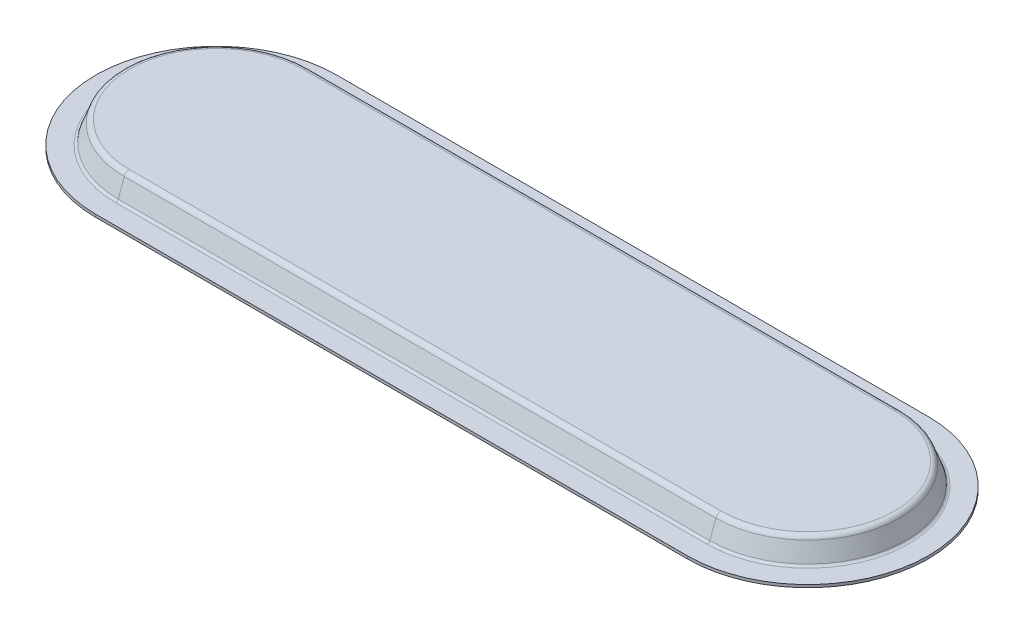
ISO-10303-21;
HEADER;
FILE_DESCRIPTION(('STEP AP214'),'2;1');
FILE_NAME('part.step','',(''),(''),'','','');
FILE_SCHEMA(('AUTOMOTIVE_DESIGN { 1 0 10303 214 1 1 1 1 }'));
ENDSEC;
DATA;
#1=APPLICATION_CONTEXT('core data for automotive mechanical design processes');
#2=APPLICATION_PROTOCOL_DEFINITION('international standard','automotive_design',2000,#1);
#3=PRODUCT_CONTEXT('',#1,'mechanical');
#4=PRODUCT('Part','Part','',(#3));
#5=PRODUCT_RELATED_PRODUCT_CATEGORY('part','',(#4));
#6=PRODUCT_DEFINITION_FORMATION('','',#4);
#7=PRODUCT_DEFINITION_CONTEXT('part definition',#1,'design');
#8=PRODUCT_DEFINITION('design','',#6,#7);
#9=PRODUCT_DEFINITION_SHAPE('','',#8);
#10=(LENGTH_UNIT() NAMED_UNIT(*) SI_UNIT(.MILLI.,.METRE.));
#11=(NAMED_UNIT(*) PLANE_ANGLE_UNIT() SI_UNIT($,.RADIAN.));
#12=(NAMED_UNIT(*) SI_UNIT($,.STERADIAN.) SOLID_ANGLE_UNIT());
#13=UNCERTAINTY_MEASURE_WITH_UNIT(LENGTH_MEASURE(1.E-05),#10,'distance_accuracy_value','');
#14=(GEOMETRIC_REPRESENTATION_CONTEXT(3) GLOBAL_UNCERTAINTY_ASSIGNED_CONTEXT((#13)) GLOBAL_UNIT_ASSIGNED_CONTEXT((#10,
#11,#12)) REPRESENTATION_CONTEXT('',''));
#15=CARTESIAN_POINT('',(0.,0.,0.));
#16=DIRECTION('',(0.,0.,1.));
#17=DIRECTION('',(1.,0.,0.));
#18=AXIS2_PLACEMENT_3D('',#15,#16,#17);
#19=CARTESIAN_POINT('',(171.45,-12.7,69.85));
#20=DIRECTION('',(0.,0.,-1.));
#21=DIRECTION('',(-1.,0.,0.));
#22=AXIS2_PLACEMENT_3D('',#19,#20,#21);
#23=PLANE('',#22);
#24=DIRECTION('',(-1.,0.,0.));
#25=VECTOR('',#24,1.);
#26=CARTESIAN_POINT('',(171.45,-1.5875,69.85));
#27=LINE('',#26,#25);
#28=CARTESIAN_POINT('',(171.45,-1.5875,69.85));
#29=VERTEX_POINT('',#28);
#30=CARTESIAN_POINT('',(-171.45,-1.5875,69.85));
#31=VERTEX_POINT('',#30);
#32=EDGE_CURVE('E299',#29,#31,#27,.T.);
#33=ORIENTED_EDGE('',*,*,#32,.F.);
#34=DIRECTION('',(0.,1.,0.));
#35=VECTOR('',#34,1.);
#36=CARTESIAN_POINT('',(171.45,-12.7,69.85));
#37=LINE('',#36,#35);
#38=CARTESIAN_POINT('',(171.45,0.,69.85));
#39=VERTEX_POINT('',#38);
#40=EDGE_CURVE('E242',#29,#39,#37,.T.);
#41=ORIENTED_EDGE('',*,*,#40,.T.);
#42=DIRECTION('',(-1.,0.,0.));
#43=VECTOR('',#42,1.);
#44=CARTESIAN_POINT('',(171.45,0.,69.85));
#45=LINE('',#44,#43);
#46=CARTESIAN_POINT('',(-171.45,0.,69.85));
#47=VERTEX_POINT('',#46);
#48=EDGE_CURVE('E319',#39,#47,#45,.T.);
#49=ORIENTED_EDGE('',*,*,#48,.T.);
#50=DIRECTION('',(0.,1.,0.));
#51=VECTOR('',#50,1.);
#52=CARTESIAN_POINT('',(-171.45,-12.7,69.85));
#53=LINE('',#52,#51);
#54=EDGE_CURVE('E329',#31,#47,#53,.T.);
#55=ORIENTED_EDGE('',*,*,#54,.F.);
#56=EDGE_LOOP('',(#33,#41,#49,#55));
#57=FACE_BOUND('',#56,.T.);
#58=ADVANCED_FACE('F38',(#57),#23,.F.);
#59=CARTESIAN_POINT('',(-171.45,-12.7,0.));
#60=DIRECTION('',(0.,1.,0.));
#61=DIRECTION('',(0.,0.,1.));
#62=AXIS2_PLACEMENT_3D('',#59,#60,#61);
#63=CYLINDRICAL_SURFACE('',#62,69.85);
#64=CARTESIAN_POINT('',(-171.45,-1.5875,0.));
#65=DIRECTION('',(0.,-1.,0.));
#66=DIRECTION('',(0.,0.,-1.));
#67=AXIS2_PLACEMENT_3D('',#64,#65,#66);
#68=CIRCLE('',#67,69.85);
#69=CARTESIAN_POINT('',(-171.45,-1.5875,-69.85));
#70=VERTEX_POINT('',#69);
#71=EDGE_CURVE('E55',#31,#70,#68,.T.);
#72=ORIENTED_EDGE('',*,*,#71,.F.);
#73=ORIENTED_EDGE('',*,*,#54,.T.);
#74=CARTESIAN_POINT('',(-171.45,0.,0.));
#75=DIRECTION('',(0.,-1.,0.));
#76=DIRECTION('',(0.,0.,-1.));
#77=AXIS2_PLACEMENT_3D('',#74,#75,#76);
#78=CIRCLE('',#77,69.85);
#79=CARTESIAN_POINT('',(-171.45,0.,-69.85));
#80=VERTEX_POINT('',#79);
#81=EDGE_CURVE('E321',#47,#80,#78,.T.);
#82=ORIENTED_EDGE('',*,*,#81,.T.);
#83=DIRECTION('',(0.,1.,0.));
#84=VECTOR('',#83,1.);
#85=CARTESIAN_POINT('',(-171.45,-12.7,-69.85));
#86=LINE('',#85,#84);
#87=EDGE_CURVE('E327',#70,#80,#86,.T.);
#88=ORIENTED_EDGE('',*,*,#87,.F.);
#89=EDGE_LOOP('',(#72,#73,#82,#88));
#90=FACE_BOUND('',#89,.T.);
#91=ADVANCED_FACE('F423',(#90),#63,.T.);
#92=CARTESIAN_POINT('',(-171.45,-12.7,-69.85));
#93=DIRECTION('',(0.,0.,1.));
#94=DIRECTION('',(1.,0.,0.));
#95=AXIS2_PLACEMENT_3D('',#92,#93,#94);
#96=PLANE('',#95);
#97=DIRECTION('',(1.,0.,0.));
#98=VECTOR('',#97,1.);
#99=CARTESIAN_POINT('',(-171.45,0.,-69.85));
#100=LINE('',#99,#98);
#101=CARTESIAN_POINT('',(171.45,0.,-69.85));
#102=VERTEX_POINT('',#101);
#103=EDGE_CURVE('E325',#80,#102,#100,.T.);
#104=ORIENTED_EDGE('',*,*,#103,.T.);
#105=DIRECTION('',(0.,1.,0.));
#106=VECTOR('',#105,1.);
#107=CARTESIAN_POINT('',(171.45,-12.7,-69.85));
#108=LINE('',#107,#106);
#109=CARTESIAN_POINT('',(171.45,-1.5875,-69.85));
#110=VERTEX_POINT('',#109);
#111=EDGE_CURVE('E238',#110,#102,#108,.T.);
#112=ORIENTED_EDGE('',*,*,#111,.F.);
#113=DIRECTION('',(1.,0.,0.));
#114=VECTOR('',#113,1.);
#115=CARTESIAN_POINT('',(-171.45,-1.5875,-69.85));
#116=LINE('',#115,#114);
#117=EDGE_CURVE('E284',#70,#110,#116,.T.);
#118=ORIENTED_EDGE('',*,*,#117,.F.);
#119=ORIENTED_EDGE('',*,*,#87,.T.);
#120=EDGE_LOOP('',(#104,#112,#118,#119));
#121=FACE_BOUND('',#120,.T.);
#122=ADVANCED_FACE('F429',(#121),#96,.F.);
#123=CARTESIAN_POINT('',(-171.45,0.,-57.15));
#124=DIRECTION('',(0.,0.342020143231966,-0.939692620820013));
#125=DIRECTION('',(0.,0.939692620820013,0.342020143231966));
#126=AXIS2_PLACEMENT_3D('',#123,#124,#125);
#127=PLANE('',#126);
#128=DIRECTION('',(1.,0.,0.));
#129=VECTOR('',#128,1.);
#130=CARTESIAN_POINT('',(171.45,10.6109139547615,-53.2879431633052));
#131=LINE('',#130,#129);
#132=CARTESIAN_POINT('',(-171.45,10.6109139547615,-53.2879431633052));
#133=VERTEX_POINT('',#132);
#134=CARTESIAN_POINT('',(171.45,10.6109139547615,-53.2879431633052));
#135=VERTEX_POINT('',#134);
#136=EDGE_CURVE('E353',#133,#135,#131,.T.);
#137=ORIENTED_EDGE('',*,*,#136,.T.);
#138=DIRECTION('',(0.,-0.939692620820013,-0.342020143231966));
#139=VECTOR('',#138,1.);
#140=CARTESIAN_POINT('',(171.45,0.,-57.15));
#141=LINE('',#140,#139);
#142=CARTESIAN_POINT('',(171.45,1.04454302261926,-56.7698174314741));
#143=VERTEX_POINT('',#142);
#144=EDGE_CURVE('E248',#135,#143,#141,.T.);
#145=ORIENTED_EDGE('',*,*,#144,.T.);
#146=DIRECTION('',(1.,0.,0.));
#147=VECTOR('',#146,1.);
#148=CARTESIAN_POINT('',(-171.45,1.04454302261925,-56.7698174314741));
#149=LINE('',#148,#147);
#150=CARTESIAN_POINT('',(-171.45,1.04454302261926,-56.7698174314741));
#151=VERTEX_POINT('',#150);
#152=EDGE_CURVE('E345',#143,#151,#149,.F.);
#153=ORIENTED_EDGE('',*,*,#152,.T.);
#154=DIRECTION('',(0.,-0.939692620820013,-0.342020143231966));
#155=VECTOR('',#154,1.);
#156=CARTESIAN_POINT('',(-171.45,0.,-57.15));
#157=LINE('',#156,#155);
#158=EDGE_CURVE('E334',#133,#151,#157,.T.);
#159=ORIENTED_EDGE('',*,*,#158,.F.);
#160=EDGE_LOOP('',(#137,#145,#153,#159));
#161=FACE_BOUND('',#160,.T.);
#162=ADVANCED_FACE('F394',(#161),#127,.T.);
#163=CARTESIAN_POINT('',(-171.45,0.,0.));
#164=DIRECTION('',(0.,-1.,0.));
#165=DIRECTION('',(0.,0.,1.));
#166=AXIS2_PLACEMENT_3D('',#163,#164,#165);
#167=CONICAL_SURFACE('',#166,57.15,0.34906585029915);
#168=DIRECTION('',(0.,-0.939692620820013,0.342020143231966));
#169=VECTOR('',#168,1.);
#170=CARTESIAN_POINT('',(-171.45,0.,57.15));
#171=LINE('',#170,#169);
#172=CARTESIAN_POINT('',(-171.45,10.6109139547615,53.2879431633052));
#173=VERTEX_POINT('',#172);
#174=CARTESIAN_POINT('',(-171.45,1.04454302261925,56.7698174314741));
#175=VERTEX_POINT('',#174);
#176=EDGE_CURVE('E332',#173,#175,#171,.T.);
#177=ORIENTED_EDGE('',*,*,#176,.F.);
#178=CARTESIAN_POINT('',(-171.45,10.6109139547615,0.));
#179=DIRECTION('',(0.,1.,0.));
#180=DIRECTION('',(0.,0.,1.));
#181=AXIS2_PLACEMENT_3D('',#178,#179,#180);
#182=CIRCLE('',#181,53.2879431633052);
#183=EDGE_CURVE('E47',#173,#133,#182,.F.);
#184=ORIENTED_EDGE('',*,*,#183,.T.);
#185=ORIENTED_EDGE('',*,*,#158,.T.);
#186=CARTESIAN_POINT('',(-171.45,1.04454302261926,0.));
#187=DIRECTION('',(0.,-1.,0.));
#188=DIRECTION('',(0.,0.,-1.));
#189=AXIS2_PLACEMENT_3D('',#186,#187,#188);
#190=CIRCLE('',#189,56.7698174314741);
#191=EDGE_CURVE('E347',#151,#175,#190,.F.);
#192=ORIENTED_EDGE('',*,*,#191,.T.);
#193=EDGE_LOOP('',(#177,#184,#185,#192));
#194=FACE_BOUND('',#193,.T.);
#195=ADVANCED_FACE('F397',(#194),#167,.T.);
#196=CARTESIAN_POINT('',(-171.45,0.,57.15));
#197=DIRECTION('',(0.,0.342020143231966,0.939692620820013));
#198=DIRECTION('',(0.,-0.939692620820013,0.342020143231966));
#199=AXIS2_PLACEMENT_3D('',#196,#197,#198);
#200=PLANE('',#199);
#201=DIRECTION('',(1.,0.,0.));
#202=VECTOR('',#201,1.);
#203=CARTESIAN_POINT('',(171.45,1.04454302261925,56.7698174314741));
#204=LINE('',#203,#202);
#205=CARTESIAN_POINT('',(171.45,1.04454302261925,56.7698174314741));
#206=VERTEX_POINT('',#205);
#207=EDGE_CURVE('E351',#175,#206,#204,.T.);
#208=ORIENTED_EDGE('',*,*,#207,.T.);
#209=DIRECTION('',(0.,-0.939692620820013,0.342020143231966));
#210=VECTOR('',#209,1.);
#211=CARTESIAN_POINT('',(171.45,0.,57.15));
#212=LINE('',#211,#210);
#213=CARTESIAN_POINT('',(171.45,10.6109139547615,53.2879431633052));
#214=VERTEX_POINT('',#213);
#215=EDGE_CURVE('E245',#214,#206,#212,.T.);
#216=ORIENTED_EDGE('',*,*,#215,.F.);
#217=DIRECTION('',(1.,0.,0.));
#218=VECTOR('',#217,1.);
#219=CARTESIAN_POINT('',(-171.45,10.6109139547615,53.2879431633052));
#220=LINE('',#219,#218);
#221=EDGE_CURVE('E11',#214,#173,#220,.F.);
#222=ORIENTED_EDGE('',*,*,#221,.T.);
#223=ORIENTED_EDGE('',*,*,#176,.T.);
#224=EDGE_LOOP('',(#208,#216,#222,#223));
#225=FACE_BOUND('',#224,.T.);
#226=ADVANCED_FACE('F412',(#225),#200,.T.);
#227=CARTESIAN_POINT('',(171.45,12.7,0.));
#228=DIRECTION('',(0.,-1.,0.));
#229=DIRECTION('',(0.,0.,-1.));
#230=AXIS2_PLACEMENT_3D('',#227,#228,#229);
#231=PLANE('',#230);
#232=DIRECTION('',(-1.,0.,0.));
#233=VECTOR('',#232,1.);
#234=CARTESIAN_POINT('',(171.45,12.7,50.3044190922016));
#235=LINE('',#234,#233);
#236=CARTESIAN_POINT('',(-171.45,12.7,50.3044190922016));
#237=VERTEX_POINT('',#236);
#238=CARTESIAN_POINT('',(171.45,12.7,50.3044190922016));
#239=VERTEX_POINT('',#238);
#240=EDGE_CURVE('E360',#237,#239,#235,.F.);
#241=ORIENTED_EDGE('',*,*,#240,.T.);
#242=CARTESIAN_POINT('',(171.45,12.7,0.));
#243=DIRECTION('',(0.,1.,0.));
#244=DIRECTION('',(0.,0.,-1.));
#245=AXIS2_PLACEMENT_3D('',#242,#243,#244);
#246=CIRCLE('',#245,50.3044190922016);
#247=CARTESIAN_POINT('',(171.45,12.7,-50.3044190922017));
#248=VERTEX_POINT('',#247);
#249=EDGE_CURVE('E259',#248,#239,#246,.F.);
#250=ORIENTED_EDGE('',*,*,#249,.F.);
#251=DIRECTION('',(1.,0.,0.));
#252=VECTOR('',#251,1.);
#253=CARTESIAN_POINT('',(-171.45,12.7,-50.3044190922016));
#254=LINE('',#253,#252);
#255=CARTESIAN_POINT('',(-171.45,12.7,-50.3044190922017));
#256=VERTEX_POINT('',#255);
#257=EDGE_CURVE('E365',#248,#256,#254,.F.);
#258=ORIENTED_EDGE('',*,*,#257,.T.);
#259=CARTESIAN_POINT('',(-171.45,12.7,0.));
#260=DIRECTION('',(0.,-1.,0.));
#261=DIRECTION('',(0.,0.,-1.));
#262=AXIS2_PLACEMENT_3D('',#259,#260,#261);
#263=CIRCLE('',#262,50.3044190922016);
#264=EDGE_CURVE('E362',#256,#237,#263,.F.);
#265=ORIENTED_EDGE('',*,*,#264,.T.);
#266=EDGE_LOOP('',(#241,#250,#258,#265));
#267=FACE_BOUND('',#266,.T.);
#268=ADVANCED_FACE('F383',(#267),#231,.F.);
#269=CARTESIAN_POINT('',(171.45,0.,0.));
#270=DIRECTION('',(0.,-1.,0.));
#271=DIRECTION('',(0.,0.,-1.));
#272=AXIS2_PLACEMENT_3D('',#269,#270,#271);
#273=PLANE('',#272);
#274=CARTESIAN_POINT('',(171.45,0.,0.));
#275=DIRECTION('',(0.,1.,0.));
#276=DIRECTION('',(0.,0.,-1.));
#277=AXIS2_PLACEMENT_3D('',#274,#275,#276);
#278=CIRCLE('',#277,58.2615794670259);
#279=CARTESIAN_POINT('',(171.45,0.,58.2615794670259));
#280=VERTEX_POINT('',#279);
#281=CARTESIAN_POINT('',(171.45,0.,-58.2615794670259));
#282=VERTEX_POINT('',#281);
#283=EDGE_CURVE('E251',#280,#282,#278,.T.);
#284=ORIENTED_EDGE('',*,*,#283,.F.);
#285=DIRECTION('',(-1.,0.,0.));
#286=VECTOR('',#285,1.);
#287=CARTESIAN_POINT('',(-171.45,0.,58.2615794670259));
#288=LINE('',#287,#286);
#289=CARTESIAN_POINT('',(-171.45,0.,58.2615794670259));
#290=VERTEX_POINT('',#289);
#291=EDGE_CURVE('E337',#280,#290,#288,.T.);
#292=ORIENTED_EDGE('',*,*,#291,.T.);
#293=CARTESIAN_POINT('',(-171.45,0.,0.));
#294=DIRECTION('',(0.,-1.,0.));
#295=DIRECTION('',(0.,0.,-1.));
#296=AXIS2_PLACEMENT_3D('',#293,#294,#295);
#297=CIRCLE('',#296,58.2615794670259);
#298=CARTESIAN_POINT('',(-171.45,0.,-58.2615794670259));
#299=VERTEX_POINT('',#298);
#300=EDGE_CURVE('E339',#290,#299,#297,.T.);
#301=ORIENTED_EDGE('',*,*,#300,.T.);
#302=DIRECTION('',(1.,0.,0.));
#303=VECTOR('',#302,1.);
#304=CARTESIAN_POINT('',(171.45,0.,-58.2615794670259));
#305=LINE('',#304,#303);
#306=EDGE_CURVE('E342',#299,#282,#305,.T.);
#307=ORIENTED_EDGE('',*,*,#306,.T.);
#308=EDGE_LOOP('',(#284,#292,#301,#307));
#309=FACE_BOUND('',#308,.T.);
#310=ORIENTED_EDGE('',*,*,#48,.F.);
#311=CARTESIAN_POINT('',(171.45,0.,0.));
#312=DIRECTION('',(0.,1.,0.));
#313=DIRECTION('',(0.,0.,-1.));
#314=AXIS2_PLACEMENT_3D('',#311,#312,#313);
#315=CIRCLE('',#314,69.85);
#316=EDGE_CURVE('E235',#39,#102,#315,.T.);
#317=ORIENTED_EDGE('',*,*,#316,.T.);
#318=ORIENTED_EDGE('',*,*,#103,.F.);
#319=ORIENTED_EDGE('',*,*,#81,.F.);
#320=EDGE_LOOP('',(#310,#317,#318,#319));
#321=FACE_BOUND('',#320,.T.);
#322=ADVANCED_FACE('F419',(#309,#321),#273,.F.);
#323=CARTESIAN_POINT('',(-171.45,1.5875,58.2615794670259));
#324=DIRECTION('',(1.,0.,0.));
#325=DIRECTION('',(0.,0.,-1.));
#326=AXIS2_PLACEMENT_3D('',#323,#324,#325);
#327=CYLINDRICAL_SURFACE('',#326,1.5875);
#328=ORIENTED_EDGE('',*,*,#291,.F.);
#329=CARTESIAN_POINT('',(171.45,1.5875,58.2615794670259));
#330=DIRECTION('',(1.,0.,0.));
#331=DIRECTION('',(0.,0.,-1.));
#332=AXIS2_PLACEMENT_3D('',#329,#330,#331);
#333=CIRCLE('',#332,1.5875);
#334=EDGE_CURVE('E239',#280,#206,#333,.T.);
#335=ORIENTED_EDGE('',*,*,#334,.T.);
#336=ORIENTED_EDGE('',*,*,#207,.F.);
#337=CARTESIAN_POINT('',(-171.45,1.5875,58.2615794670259));
#338=DIRECTION('',(1.,0.,0.));
#339=DIRECTION('',(0.,0.,-1.));
#340=AXIS2_PLACEMENT_3D('',#337,#338,#339);
#341=CIRCLE('',#340,1.5875);
#342=EDGE_CURVE('E322',#290,#175,#341,.T.);
#343=ORIENTED_EDGE('',*,*,#342,.F.);
#344=EDGE_LOOP('',(#328,#335,#336,#343));
#345=FACE_BOUND('',#344,.T.);
#346=ADVANCED_FACE('F410',(#345),#327,.F.);
#347=CARTESIAN_POINT('',(-171.45,1.5875,0.));
#348=DIRECTION('',(0.,-1.,0.));
#349=DIRECTION('',(0.,0.,-1.));
#350=AXIS2_PLACEMENT_3D('',#347,#348,#349);
#351=TOROIDAL_SURFACE('',#350,58.2615794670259,1.5875);
#352=ORIENTED_EDGE('',*,*,#342,.T.);
#353=ORIENTED_EDGE('',*,*,#191,.F.);
#354=CARTESIAN_POINT('',(-171.45,1.5875,-58.2615794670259));
#355=DIRECTION('',(-1.,0.,0.));
#356=DIRECTION('',(0.,0.,1.));
#357=AXIS2_PLACEMENT_3D('',#354,#355,#356);
#358=CIRCLE('',#357,1.5875);
#359=EDGE_CURVE('E354',#299,#151,#358,.T.);
#360=ORIENTED_EDGE('',*,*,#359,.F.);
#361=ORIENTED_EDGE('',*,*,#300,.F.);
#362=EDGE_LOOP('',(#352,#353,#360,#361));
#363=FACE_BOUND('',#362,.T.);
#364=ADVANCED_FACE('F407',(#363),#351,.F.);
#365=CARTESIAN_POINT('',(171.45,1.5875,-58.2615794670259));
#366=DIRECTION('',(1.,0.,0.));
#367=DIRECTION('',(0.,0.,-1.));
#368=AXIS2_PLACEMENT_3D('',#365,#366,#367);
#369=CYLINDRICAL_SURFACE('',#368,1.5875);
#370=ORIENTED_EDGE('',*,*,#152,.F.);
#371=CARTESIAN_POINT('',(171.45,1.5875,-58.2615794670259));
#372=DIRECTION('',(-1.,0.,0.));
#373=DIRECTION('',(0.,0.,1.));
#374=AXIS2_PLACEMENT_3D('',#371,#372,#373);
#375=CIRCLE('',#374,1.5875);
#376=EDGE_CURVE('E260',#282,#143,#375,.T.);
#377=ORIENTED_EDGE('',*,*,#376,.F.);
#378=ORIENTED_EDGE('',*,*,#306,.F.);
#379=ORIENTED_EDGE('',*,*,#359,.T.);
#380=EDGE_LOOP('',(#370,#377,#378,#379));
#381=FACE_BOUND('',#380,.T.);
#382=ADVANCED_FACE('F403',(#381),#369,.F.);
#383=CARTESIAN_POINT('',(171.45,9.525,50.3044190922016));
#384=DIRECTION('',(-1.,0.,0.));
#385=DIRECTION('',(0.,0.,1.));
#386=AXIS2_PLACEMENT_3D('',#383,#384,#385);
#387=CYLINDRICAL_SURFACE('',#386,3.175);
#388=ORIENTED_EDGE('',*,*,#221,.F.);
#389=CARTESIAN_POINT('',(171.45,9.525,50.3044190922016));
#390=DIRECTION('',(-1.,0.,0.));
#391=DIRECTION('',(0.,0.,1.));
#392=AXIS2_PLACEMENT_3D('',#389,#390,#391);
#393=CIRCLE('',#392,3.175);
#394=EDGE_CURVE('E263',#214,#239,#393,.T.);
#395=ORIENTED_EDGE('',*,*,#394,.T.);
#396=ORIENTED_EDGE('',*,*,#240,.F.);
#397=CARTESIAN_POINT('',(-171.45,9.525,50.3044190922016));
#398=DIRECTION('',(-1.,0.,0.));
#399=DIRECTION('',(0.,0.,1.));
#400=AXIS2_PLACEMENT_3D('',#397,#398,#399);
#401=CIRCLE('',#400,3.175);
#402=EDGE_CURVE('E42',#173,#237,#401,.T.);
#403=ORIENTED_EDGE('',*,*,#402,.F.);
#404=EDGE_LOOP('',(#388,#395,#396,#403));
#405=FACE_BOUND('',#404,.T.);
#406=ADVANCED_FACE('F40',(#405),#387,.T.);
#407=CARTESIAN_POINT('',(-171.45,9.525,0.));
#408=DIRECTION('',(0.,-1.,0.));
#409=DIRECTION('',(0.,0.,-1.));
#410=AXIS2_PLACEMENT_3D('',#407,#408,#409);
#411=TOROIDAL_SURFACE('',#410,50.3044190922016,3.175);
#412=ORIENTED_EDGE('',*,*,#402,.T.);
#413=ORIENTED_EDGE('',*,*,#264,.F.);
#414=CARTESIAN_POINT('',(-171.45,9.525,-50.3044190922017));
#415=DIRECTION('',(1.,0.,0.));
#416=DIRECTION('',(0.,0.,-1.));
#417=AXIS2_PLACEMENT_3D('',#414,#415,#416);
#418=CIRCLE('',#417,3.175);
#419=EDGE_CURVE('E294',#133,#256,#418,.T.);
#420=ORIENTED_EDGE('',*,*,#419,.F.);
#421=ORIENTED_EDGE('',*,*,#183,.F.);
#422=EDGE_LOOP('',(#412,#413,#420,#421));
#423=FACE_BOUND('',#422,.T.);
#424=ADVANCED_FACE('F377',(#423),#411,.T.);
#425=CARTESIAN_POINT('',(-171.45,9.525,-50.3044190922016));
#426=DIRECTION('',(-1.,0.,0.));
#427=DIRECTION('',(0.,0.,1.));
#428=AXIS2_PLACEMENT_3D('',#425,#426,#427);
#429=CYLINDRICAL_SURFACE('',#428,3.175);
#430=ORIENTED_EDGE('',*,*,#257,.F.);
#431=CARTESIAN_POINT('',(171.45,9.525,-50.3044190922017));
#432=DIRECTION('',(1.,0.,0.));
#433=DIRECTION('',(0.,0.,-1.));
#434=AXIS2_PLACEMENT_3D('',#431,#432,#433);
#435=CIRCLE('',#434,3.175);
#436=EDGE_CURVE('E223',#135,#248,#435,.T.);
#437=ORIENTED_EDGE('',*,*,#436,.F.);
#438=ORIENTED_EDGE('',*,*,#136,.F.);
#439=ORIENTED_EDGE('',*,*,#419,.T.);
#440=EDGE_LOOP('',(#430,#437,#438,#439));
#441=FACE_BOUND('',#440,.T.);
#442=ADVANCED_FACE('F385',(#441),#429,.T.);
#443=CARTESIAN_POINT('',(-171.45,-0.542956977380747,-55.6582379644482));
#444=DIRECTION('',(0.,0.342020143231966,-0.939692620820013));
#445=DIRECTION('',(0.,0.939692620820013,0.342020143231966));
#446=AXIS2_PLACEMENT_3D('',#443,#444,#445);
#447=PLANE('',#446);
#448=DIRECTION('',(1.,0.,0.));
#449=VECTOR('',#448,1.);
#450=CARTESIAN_POINT('',(-171.45,0.501586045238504,-55.2780553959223));
#451=LINE('',#450,#449);
#452=CARTESIAN_POINT('',(171.45,0.501586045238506,-55.2780553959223));
#453=VERTEX_POINT('',#452);
#454=CARTESIAN_POINT('',(-171.45,0.501586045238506,-55.2780553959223));
#455=VERTEX_POINT('',#454);
#456=EDGE_CURVE('E175',#453,#455,#451,.F.);
#457=ORIENTED_EDGE('',*,*,#456,.F.);
#458=DIRECTION('',(0.,-0.939692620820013,-0.342020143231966));
#459=VECTOR('',#458,1.);
#460=CARTESIAN_POINT('',(171.45,-0.542956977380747,-55.6582379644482));
#461=LINE('',#460,#459);
#462=CARTESIAN_POINT('',(171.45,10.0679569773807,-51.7961811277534));
#463=VERTEX_POINT('',#462);
#464=EDGE_CURVE('E180',#463,#453,#461,.T.);
#465=ORIENTED_EDGE('',*,*,#464,.F.);
#466=DIRECTION('',(1.,0.,0.));
#467=VECTOR('',#466,1.);
#468=CARTESIAN_POINT('',(-171.45,10.0679569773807,-51.7961811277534));
#469=LINE('',#468,#467);
#470=CARTESIAN_POINT('',(-171.45,10.0679569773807,-51.7961811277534));
#471=VERTEX_POINT('',#470);
#472=EDGE_CURVE('E279',#471,#463,#469,.T.);
#473=ORIENTED_EDGE('',*,*,#472,.F.);
#474=DIRECTION('',(0.,-0.939692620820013,-0.342020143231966));
#475=VECTOR('',#474,1.);
#476=CARTESIAN_POINT('',(-171.45,-0.542956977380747,-55.6582379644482));
#477=LINE('',#476,#475);
#478=EDGE_CURVE('E182',#471,#455,#477,.T.);
#479=ORIENTED_EDGE('',*,*,#478,.T.);
#480=EDGE_LOOP('',(#457,#465,#473,#479));
#481=FACE_BOUND('',#480,.T.);
#482=ADVANCED_FACE('F177',(#481),#447,.F.);
#483=CARTESIAN_POINT('',(-171.45,-0.542956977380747,0.));
#484=DIRECTION('',(0.,-1.,0.));
#485=DIRECTION('',(0.,0.,1.));
#486=AXIS2_PLACEMENT_3D('',#483,#484,#485);
#487=CONICAL_SURFACE('',#486,55.6582379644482,0.34906585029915);
#488=DIRECTION('',(0.,-0.939692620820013,0.342020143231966));
#489=VECTOR('',#488,1.);
#490=CARTESIAN_POINT('',(-171.45,-0.542956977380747,55.6582379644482));
#491=LINE('',#490,#489);
#492=CARTESIAN_POINT('',(-171.45,10.0679569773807,51.7961811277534));
#493=VERTEX_POINT('',#492);
#494=CARTESIAN_POINT('',(-171.45,0.501586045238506,55.2780553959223));
#495=VERTEX_POINT('',#494);
#496=EDGE_CURVE('E278',#493,#495,#491,.T.);
#497=ORIENTED_EDGE('',*,*,#496,.T.);
#498=CARTESIAN_POINT('',(-171.45,0.501586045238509,0.));
#499=DIRECTION('',(0.,-1.,0.));
#500=DIRECTION('',(0.,0.,-1.));
#501=AXIS2_PLACEMENT_3D('',#498,#499,#500);
#502=CIRCLE('',#501,55.2780553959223);
#503=EDGE_CURVE('E186',#455,#495,#502,.F.);
#504=ORIENTED_EDGE('',*,*,#503,.F.);
#505=ORIENTED_EDGE('',*,*,#478,.F.);
#506=CARTESIAN_POINT('',(-171.45,10.0679569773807,0.));
#507=DIRECTION('',(0.,-1.,0.));
#508=DIRECTION('',(0.,0.,-1.));
#509=AXIS2_PLACEMENT_3D('',#506,#507,#508);
#510=CIRCLE('',#509,51.7961811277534);
#511=EDGE_CURVE('E285',#493,#471,#510,.T.);
#512=ORIENTED_EDGE('',*,*,#511,.F.);
#513=EDGE_LOOP('',(#497,#504,#505,#512));
#514=FACE_BOUND('',#513,.T.);
#515=ADVANCED_FACE('F473',(#514),#487,.F.);
#516=CARTESIAN_POINT('',(-171.45,-0.542956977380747,55.6582379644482));
#517=DIRECTION('',(0.,0.342020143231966,0.939692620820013));
#518=DIRECTION('',(0.,-0.939692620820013,0.342020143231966));
#519=AXIS2_PLACEMENT_3D('',#516,#517,#518);
#520=PLANE('',#519);
#521=DIRECTION('',(1.,0.,0.));
#522=VECTOR('',#521,1.);
#523=CARTESIAN_POINT('',(-171.45,10.0679569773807,51.7961811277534));
#524=LINE('',#523,#522);
#525=CARTESIAN_POINT('',(171.45,10.0679569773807,51.7961811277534));
#526=VERTEX_POINT('',#525);
#527=EDGE_CURVE('E288',#526,#493,#524,.F.);
#528=ORIENTED_EDGE('',*,*,#527,.F.);
#529=DIRECTION('',(0.,-0.939692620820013,0.342020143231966));
#530=VECTOR('',#529,1.);
#531=CARTESIAN_POINT('',(171.45,-0.542956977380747,55.6582379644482));
#532=LINE('',#531,#530);
#533=CARTESIAN_POINT('',(171.45,0.501586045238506,55.2780553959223));
#534=VERTEX_POINT('',#533);
#535=EDGE_CURVE('E216',#526,#534,#532,.T.);
#536=ORIENTED_EDGE('',*,*,#535,.T.);
#537=DIRECTION('',(1.,0.,0.));
#538=VECTOR('',#537,1.);
#539=CARTESIAN_POINT('',(-171.45,0.501586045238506,55.2780553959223));
#540=LINE('',#539,#538);
#541=EDGE_CURVE('E281',#495,#534,#540,.T.);
#542=ORIENTED_EDGE('',*,*,#541,.F.);
#543=ORIENTED_EDGE('',*,*,#496,.F.);
#544=EDGE_LOOP('',(#528,#536,#542,#543));
#545=FACE_BOUND('',#544,.T.);
#546=ADVANCED_FACE('F469',(#545),#520,.F.);
#547=CARTESIAN_POINT('',(171.45,11.1125,0.));
#548=DIRECTION('',(0.,-1.,0.));
#549=DIRECTION('',(0.,0.,-1.));
#550=AXIS2_PLACEMENT_3D('',#547,#548,#549);
#551=PLANE('',#550);
#552=DIRECTION('',(1.,0.,0.));
#553=VECTOR('',#552,1.);
#554=CARTESIAN_POINT('',(171.45,11.1125,-50.3044190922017));
#555=LINE('',#554,#553);
#556=CARTESIAN_POINT('',(171.45,11.1125,-50.3044190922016));
#557=VERTEX_POINT('',#556);
#558=CARTESIAN_POINT('',(-171.45,11.1125,-50.3044190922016));
#559=VERTEX_POINT('',#558);
#560=EDGE_CURVE('E289',#557,#559,#555,.F.);
#561=ORIENTED_EDGE('',*,*,#560,.F.);
#562=CARTESIAN_POINT('',(171.45,11.1125,0.));
#563=DIRECTION('',(0.,1.,0.));
#564=DIRECTION('',(0.,0.,-1.));
#565=AXIS2_PLACEMENT_3D('',#562,#563,#564);
#566=CIRCLE('',#565,50.3044190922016);
#567=CARTESIAN_POINT('',(171.45,11.1125,50.3044190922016));
#568=VERTEX_POINT('',#567);
#569=EDGE_CURVE('E209',#557,#568,#566,.F.);
#570=ORIENTED_EDGE('',*,*,#569,.T.);
#571=DIRECTION('',(1.,0.,0.));
#572=VECTOR('',#571,1.);
#573=CARTESIAN_POINT('',(171.45,11.1125,50.3044190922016));
#574=LINE('',#573,#572);
#575=CARTESIAN_POINT('',(-171.45,11.1125,50.3044190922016));
#576=VERTEX_POINT('',#575);
#577=EDGE_CURVE('E280',#576,#568,#574,.T.);
#578=ORIENTED_EDGE('',*,*,#577,.F.);
#579=CARTESIAN_POINT('',(-171.45,11.1125,0.));
#580=DIRECTION('',(0.,-1.,0.));
#581=DIRECTION('',(0.,0.,-1.));
#582=AXIS2_PLACEMENT_3D('',#579,#580,#581);
#583=CIRCLE('',#582,50.3044190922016);
#584=EDGE_CURVE('E308',#559,#576,#583,.F.);
#585=ORIENTED_EDGE('',*,*,#584,.F.);
#586=EDGE_LOOP('',(#561,#570,#578,#585));
#587=FACE_BOUND('',#586,.T.);
#588=ADVANCED_FACE('F465',(#587),#551,.T.);
#589=CARTESIAN_POINT('',(171.45,-1.5875,0.));
#590=DIRECTION('',(0.,-1.,0.));
#591=DIRECTION('',(0.,0.,-1.));
#592=AXIS2_PLACEMENT_3D('',#589,#590,#591);
#593=PLANE('',#592);
#594=DIRECTION('',(1.,0.,0.));
#595=VECTOR('',#594,1.);
#596=CARTESIAN_POINT('',(171.45,-1.5875,58.2615794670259));
#597=LINE('',#596,#595);
#598=CARTESIAN_POINT('',(171.45,-1.5875,58.2615794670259));
#599=VERTEX_POINT('',#598);
#600=CARTESIAN_POINT('',(-171.45,-1.5875,58.2615794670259));
#601=VERTEX_POINT('',#600);
#602=EDGE_CURVE('E277',#599,#601,#597,.F.);
#603=ORIENTED_EDGE('',*,*,#602,.F.);
#604=CARTESIAN_POINT('',(171.45,-1.5875,0.));
#605=DIRECTION('',(0.,1.,0.));
#606=DIRECTION('',(0.,0.,-1.));
#607=AXIS2_PLACEMENT_3D('',#604,#605,#606);
#608=CIRCLE('',#607,58.2615794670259);
#609=CARTESIAN_POINT('',(171.45,-1.5875,-58.2615794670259));
#610=VERTEX_POINT('',#609);
#611=EDGE_CURVE('E210',#599,#610,#608,.T.);
#612=ORIENTED_EDGE('',*,*,#611,.T.);
#613=DIRECTION('',(1.,0.,0.));
#614=VECTOR('',#613,1.);
#615=CARTESIAN_POINT('',(171.45,-1.5875,-58.2615794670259));
#616=LINE('',#615,#614);
#617=CARTESIAN_POINT('',(-171.45,-1.5875,-58.2615794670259));
#618=VERTEX_POINT('',#617);
#619=EDGE_CURVE('E187',#618,#610,#616,.T.);
#620=ORIENTED_EDGE('',*,*,#619,.F.);
#621=CARTESIAN_POINT('',(-171.45,-1.5875,0.));
#622=DIRECTION('',(0.,-1.,0.));
#623=DIRECTION('',(0.,0.,-1.));
#624=AXIS2_PLACEMENT_3D('',#621,#622,#623);
#625=CIRCLE('',#624,58.2615794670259);
#626=EDGE_CURVE('E302',#601,#618,#625,.T.);
#627=ORIENTED_EDGE('',*,*,#626,.F.);
#628=EDGE_LOOP('',(#603,#612,#620,#627));
#629=FACE_BOUND('',#628,.T.);
#630=CARTESIAN_POINT('',(171.45,-1.5875,0.));
#631=DIRECTION('',(0.,1.,0.));
#632=DIRECTION('',(0.,0.,-1.));
#633=AXIS2_PLACEMENT_3D('',#630,#631,#632);
#634=CIRCLE('',#633,69.85);
#635=EDGE_CURVE('E220',#29,#110,#634,.T.);
#636=ORIENTED_EDGE('',*,*,#635,.F.);
#637=ORIENTED_EDGE('',*,*,#32,.T.);
#638=ORIENTED_EDGE('',*,*,#71,.T.);
#639=ORIENTED_EDGE('',*,*,#117,.T.);
#640=EDGE_LOOP('',(#636,#637,#638,#639));
#641=FACE_BOUND('',#640,.T.);
#642=ADVANCED_FACE('F461',(#629,#641),#593,.T.);
#643=CARTESIAN_POINT('',(-171.45,1.5875,58.2615794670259));
#644=DIRECTION('',(1.,0.,0.));
#645=DIRECTION('',(0.,0.,-1.));
#646=AXIS2_PLACEMENT_3D('',#643,#644,#645);
#647=CYLINDRICAL_SURFACE('',#646,3.175);
#648=ORIENTED_EDGE('',*,*,#541,.T.);
#649=CARTESIAN_POINT('',(171.45,1.5875,58.2615794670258));
#650=DIRECTION('',(1.,0.,0.));
#651=DIRECTION('',(0.,0.,-1.));
#652=AXIS2_PLACEMENT_3D('',#649,#650,#651);
#653=CIRCLE('',#652,3.175);
#654=EDGE_CURVE('E197',#599,#534,#653,.T.);
#655=ORIENTED_EDGE('',*,*,#654,.F.);
#656=ORIENTED_EDGE('',*,*,#602,.T.);
#657=CARTESIAN_POINT('',(-171.45,1.5875,58.2615794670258));
#658=DIRECTION('',(1.,0.,0.));
#659=DIRECTION('',(0.,0.,-1.));
#660=AXIS2_PLACEMENT_3D('',#657,#658,#659);
#661=CIRCLE('',#660,3.175);
#662=EDGE_CURVE('E296',#601,#495,#661,.T.);
#663=ORIENTED_EDGE('',*,*,#662,.T.);
#664=EDGE_LOOP('',(#648,#655,#656,#663));
#665=FACE_BOUND('',#664,.T.);
#666=ADVANCED_FACE('F457',(#665),#647,.T.);
#667=CARTESIAN_POINT('',(-171.45,1.5875,0.));
#668=DIRECTION('',(0.,-1.,0.));
#669=DIRECTION('',(0.,0.,-1.));
#670=AXIS2_PLACEMENT_3D('',#667,#668,#669);
#671=TOROIDAL_SURFACE('',#670,58.2615794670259,3.175);
#672=ORIENTED_EDGE('',*,*,#662,.F.);
#673=ORIENTED_EDGE('',*,*,#626,.T.);
#674=CARTESIAN_POINT('',(-171.45,1.5875,-58.2615794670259));
#675=DIRECTION('',(1.,0.,0.));
#676=DIRECTION('',(0.,0.,-1.));
#677=AXIS2_PLACEMENT_3D('',#674,#675,#676);
#678=CIRCLE('',#677,3.175);
#679=EDGE_CURVE('E300',#618,#455,#678,.F.);
#680=ORIENTED_EDGE('',*,*,#679,.T.);
#681=ORIENTED_EDGE('',*,*,#503,.T.);
#682=EDGE_LOOP('',(#672,#673,#680,#681));
#683=FACE_BOUND('',#682,.T.);
#684=ADVANCED_FACE('F454',(#683),#671,.T.);
#685=CARTESIAN_POINT('',(171.45,1.5875,-58.2615794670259));
#686=DIRECTION('',(1.,0.,0.));
#687=DIRECTION('',(0.,0.,-1.));
#688=AXIS2_PLACEMENT_3D('',#685,#686,#687);
#689=CYLINDRICAL_SURFACE('',#688,3.175);
#690=ORIENTED_EDGE('',*,*,#619,.T.);
#691=CARTESIAN_POINT('',(171.45,1.5875,-58.2615794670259));
#692=DIRECTION('',(1.,0.,0.));
#693=DIRECTION('',(0.,0.,-1.));
#694=AXIS2_PLACEMENT_3D('',#691,#692,#693);
#695=CIRCLE('',#694,3.175);
#696=EDGE_CURVE('E190',#610,#453,#695,.F.);
#697=ORIENTED_EDGE('',*,*,#696,.T.);
#698=ORIENTED_EDGE('',*,*,#456,.T.);
#699=ORIENTED_EDGE('',*,*,#679,.F.);
#700=EDGE_LOOP('',(#690,#697,#698,#699));
#701=FACE_BOUND('',#700,.T.);
#702=ADVANCED_FACE('F192',(#701),#689,.T.);
#703=CARTESIAN_POINT('',(171.45,9.525,50.3044190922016));
#704=DIRECTION('',(-1.,0.,0.));
#705=DIRECTION('',(0.,0.,1.));
#706=AXIS2_PLACEMENT_3D('',#703,#704,#705);
#707=CYLINDRICAL_SURFACE('',#706,1.5875);
#708=ORIENTED_EDGE('',*,*,#577,.T.);
#709=CARTESIAN_POINT('',(171.45,9.525,50.3044190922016));
#710=DIRECTION('',(1.,0.,0.));
#711=DIRECTION('',(0.,0.,-1.));
#712=AXIS2_PLACEMENT_3D('',#709,#710,#711);
#713=CIRCLE('',#712,1.5875);
#714=EDGE_CURVE('E198',#526,#568,#713,.F.);
#715=ORIENTED_EDGE('',*,*,#714,.F.);
#716=ORIENTED_EDGE('',*,*,#527,.T.);
#717=CARTESIAN_POINT('',(-171.45,9.525,50.3044190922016));
#718=DIRECTION('',(1.,0.,0.));
#719=DIRECTION('',(0.,0.,-1.));
#720=AXIS2_PLACEMENT_3D('',#717,#718,#719);
#721=CIRCLE('',#720,1.5875);
#722=EDGE_CURVE('E306',#493,#576,#721,.F.);
#723=ORIENTED_EDGE('',*,*,#722,.T.);
#724=EDGE_LOOP('',(#708,#715,#716,#723));
#725=FACE_BOUND('',#724,.T.);
#726=ADVANCED_FACE('F447',(#725),#707,.F.);
#727=CARTESIAN_POINT('',(-171.45,9.525,0.));
#728=DIRECTION('',(0.,-1.,0.));
#729=DIRECTION('',(0.,0.,-1.));
#730=AXIS2_PLACEMENT_3D('',#727,#728,#729);
#731=TOROIDAL_SURFACE('',#730,50.3044190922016,1.5875);
#732=ORIENTED_EDGE('',*,*,#722,.F.);
#733=ORIENTED_EDGE('',*,*,#511,.T.);
#734=CARTESIAN_POINT('',(-171.45,9.525,-50.3044190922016));
#735=DIRECTION('',(-1.,0.,0.));
#736=DIRECTION('',(0.,0.,1.));
#737=AXIS2_PLACEMENT_3D('',#734,#735,#736);
#738=CIRCLE('',#737,1.5875);
#739=EDGE_CURVE('E271',#471,#559,#738,.F.);
#740=ORIENTED_EDGE('',*,*,#739,.T.);
#741=ORIENTED_EDGE('',*,*,#584,.T.);
#742=EDGE_LOOP('',(#732,#733,#740,#741));
#743=FACE_BOUND('',#742,.T.);
#744=ADVANCED_FACE('F443',(#743),#731,.F.);
#745=CARTESIAN_POINT('',(-171.45,9.525,-50.3044190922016));
#746=DIRECTION('',(-1.,0.,0.));
#747=DIRECTION('',(0.,0.,1.));
#748=AXIS2_PLACEMENT_3D('',#745,#746,#747);
#749=CYLINDRICAL_SURFACE('',#748,1.5875);
#750=ORIENTED_EDGE('',*,*,#472,.T.);
#751=CARTESIAN_POINT('',(171.45,9.525,-50.3044190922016));
#752=DIRECTION('',(-1.,0.,0.));
#753=DIRECTION('',(0.,0.,1.));
#754=AXIS2_PLACEMENT_3D('',#751,#752,#753);
#755=CIRCLE('',#754,1.5875);
#756=EDGE_CURVE('E228',#463,#557,#755,.F.);
#757=ORIENTED_EDGE('',*,*,#756,.T.);
#758=ORIENTED_EDGE('',*,*,#560,.T.);
#759=ORIENTED_EDGE('',*,*,#739,.F.);
#760=EDGE_LOOP('',(#750,#757,#758,#759));
#761=FACE_BOUND('',#760,.T.);
#762=ADVANCED_FACE('F439',(#761),#749,.F.);
#763=CARTESIAN_POINT('',(171.45,-12.7,0.));
#764=DIRECTION('',(0.,1.,0.));
#765=DIRECTION('',(0.,0.,1.));
#766=AXIS2_PLACEMENT_3D('',#763,#764,#765);
#767=CYLINDRICAL_SURFACE('',#766,69.85);
#768=ORIENTED_EDGE('',*,*,#635,.T.);
#769=ORIENTED_EDGE('',*,*,#111,.T.);
#770=ORIENTED_EDGE('',*,*,#316,.F.);
#771=ORIENTED_EDGE('',*,*,#40,.F.);
#772=EDGE_LOOP('',(#768,#769,#770,#771));
#773=FACE_BOUND('',#772,.T.);
#774=ADVANCED_FACE('F442',(#773),#767,.T.);
#775=CARTESIAN_POINT('',(171.45,0.,0.));
#776=DIRECTION('',(0.,-1.,0.));
#777=DIRECTION('',(0.,0.,1.));
#778=AXIS2_PLACEMENT_3D('',#775,#776,#777);
#779=CONICAL_SURFACE('',#778,57.15,0.34906585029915);
#780=ORIENTED_EDGE('',*,*,#215,.T.);
#781=CARTESIAN_POINT('',(171.45,1.04454302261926,0.));
#782=DIRECTION('',(0.,1.,0.));
#783=DIRECTION('',(0.,0.,-1.));
#784=AXIS2_PLACEMENT_3D('',#781,#782,#783);
#785=CIRCLE('',#784,56.7698174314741);
#786=EDGE_CURVE('E255',#143,#206,#785,.F.);
#787=ORIENTED_EDGE('',*,*,#786,.F.);
#788=ORIENTED_EDGE('',*,*,#144,.F.);
#789=CARTESIAN_POINT('',(171.45,10.6109139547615,0.));
#790=DIRECTION('',(0.,-1.,0.));
#791=DIRECTION('',(0.,0.,1.));
#792=AXIS2_PLACEMENT_3D('',#789,#790,#791);
#793=CIRCLE('',#792,53.2879431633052);
#794=EDGE_CURVE('E268',#214,#135,#793,.F.);
#795=ORIENTED_EDGE('',*,*,#794,.F.);
#796=EDGE_LOOP('',(#780,#787,#788,#795));
#797=FACE_BOUND('',#796,.T.);
#798=ADVANCED_FACE('F392',(#797),#779,.T.);
#799=CARTESIAN_POINT('',(171.45,1.5875,0.));
#800=DIRECTION('',(0.,-1.,0.));
#801=DIRECTION('',(0.,0.,-1.));
#802=AXIS2_PLACEMENT_3D('',#799,#800,#801);
#803=TOROIDAL_SURFACE('',#802,58.2615794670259,1.5875);
#804=ORIENTED_EDGE('',*,*,#334,.F.);
#805=ORIENTED_EDGE('',*,*,#283,.T.);
#806=ORIENTED_EDGE('',*,*,#376,.T.);
#807=ORIENTED_EDGE('',*,*,#786,.T.);
#808=EDGE_LOOP('',(#804,#805,#806,#807));
#809=FACE_BOUND('',#808,.T.);
#810=ADVANCED_FACE('F482',(#809),#803,.F.);
#811=CARTESIAN_POINT('',(171.45,9.525,0.));
#812=DIRECTION('',(0.,-1.,0.));
#813=DIRECTION('',(0.,0.,-1.));
#814=AXIS2_PLACEMENT_3D('',#811,#812,#813);
#815=TOROIDAL_SURFACE('',#814,50.3044190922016,3.175);
#816=ORIENTED_EDGE('',*,*,#394,.F.);
#817=ORIENTED_EDGE('',*,*,#794,.T.);
#818=ORIENTED_EDGE('',*,*,#436,.T.);
#819=ORIENTED_EDGE('',*,*,#249,.T.);
#820=EDGE_LOOP('',(#816,#817,#818,#819));
#821=FACE_BOUND('',#820,.T.);
#822=ADVANCED_FACE('F387',(#821),#815,.T.);
#823=CARTESIAN_POINT('',(171.45,-0.542956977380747,0.));
#824=DIRECTION('',(0.,-1.,0.));
#825=DIRECTION('',(0.,0.,1.));
#826=AXIS2_PLACEMENT_3D('',#823,#824,#825);
#827=CONICAL_SURFACE('',#826,55.6582379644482,0.34906585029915);
#828=ORIENTED_EDGE('',*,*,#535,.F.);
#829=CARTESIAN_POINT('',(171.45,10.0679569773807,0.));
#830=DIRECTION('',(0.,1.,0.));
#831=DIRECTION('',(0.,0.,-1.));
#832=AXIS2_PLACEMENT_3D('',#829,#830,#831);
#833=CIRCLE('',#832,51.7961811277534);
#834=EDGE_CURVE('E215',#526,#463,#833,.T.);
#835=ORIENTED_EDGE('',*,*,#834,.T.);
#836=ORIENTED_EDGE('',*,*,#464,.T.);
#837=CARTESIAN_POINT('',(171.45,0.501586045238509,0.));
#838=DIRECTION('',(0.,1.,0.));
#839=DIRECTION('',(0.,0.,-1.));
#840=AXIS2_PLACEMENT_3D('',#837,#838,#839);
#841=CIRCLE('',#840,55.2780553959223);
#842=EDGE_CURVE('E202',#453,#534,#841,.F.);
#843=ORIENTED_EDGE('',*,*,#842,.T.);
#844=EDGE_LOOP('',(#828,#835,#836,#843));
#845=FACE_BOUND('',#844,.T.);
#846=ADVANCED_FACE('F213',(#845),#827,.F.);
#847=CARTESIAN_POINT('',(171.45,1.5875,0.));
#848=DIRECTION('',(0.,-1.,0.));
#849=DIRECTION('',(0.,0.,-1.));
#850=AXIS2_PLACEMENT_3D('',#847,#848,#849);
#851=TOROIDAL_SURFACE('',#850,58.2615794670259,3.175);
#852=ORIENTED_EDGE('',*,*,#654,.T.);
#853=ORIENTED_EDGE('',*,*,#842,.F.);
#854=ORIENTED_EDGE('',*,*,#696,.F.);
#855=ORIENTED_EDGE('',*,*,#611,.F.);
#856=EDGE_LOOP('',(#852,#853,#854,#855));
#857=FACE_BOUND('',#856,.T.);
#858=ADVANCED_FACE('F203',(#857),#851,.T.);
#859=CARTESIAN_POINT('',(171.45,9.525,0.));
#860=DIRECTION('',(0.,-1.,0.));
#861=DIRECTION('',(0.,0.,-1.));
#862=AXIS2_PLACEMENT_3D('',#859,#860,#861);
#863=TOROIDAL_SURFACE('',#862,50.3044190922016,1.5875);
#864=ORIENTED_EDGE('',*,*,#714,.T.);
#865=ORIENTED_EDGE('',*,*,#569,.F.);
#866=ORIENTED_EDGE('',*,*,#756,.F.);
#867=ORIENTED_EDGE('',*,*,#834,.F.);
#868=EDGE_LOOP('',(#864,#865,#866,#867));
#869=FACE_BOUND('',#868,.T.);
#870=ADVANCED_FACE('F491',(#869),#863,.F.);
#871=CLOSED_SHELL('',(#58,#91,#122,#162,#195,#226,#268,#322,#346,#364,#382,#406,#424,#442,#482,
#515,#546,#588,#642,#666,#684,#702,#726,#744,#762,#774,#798,#810,#822,#846,#858,#870));
#872=MANIFOLD_SOLID_BREP('B2',#871);
#873=ADVANCED_BREP_SHAPE_REPRESENTATION('',(#18,#872),#14);
#874=SHAPE_DEFINITION_REPRESENTATION(#9,#873);
ENDSEC;
END-ISO-10303-21;
